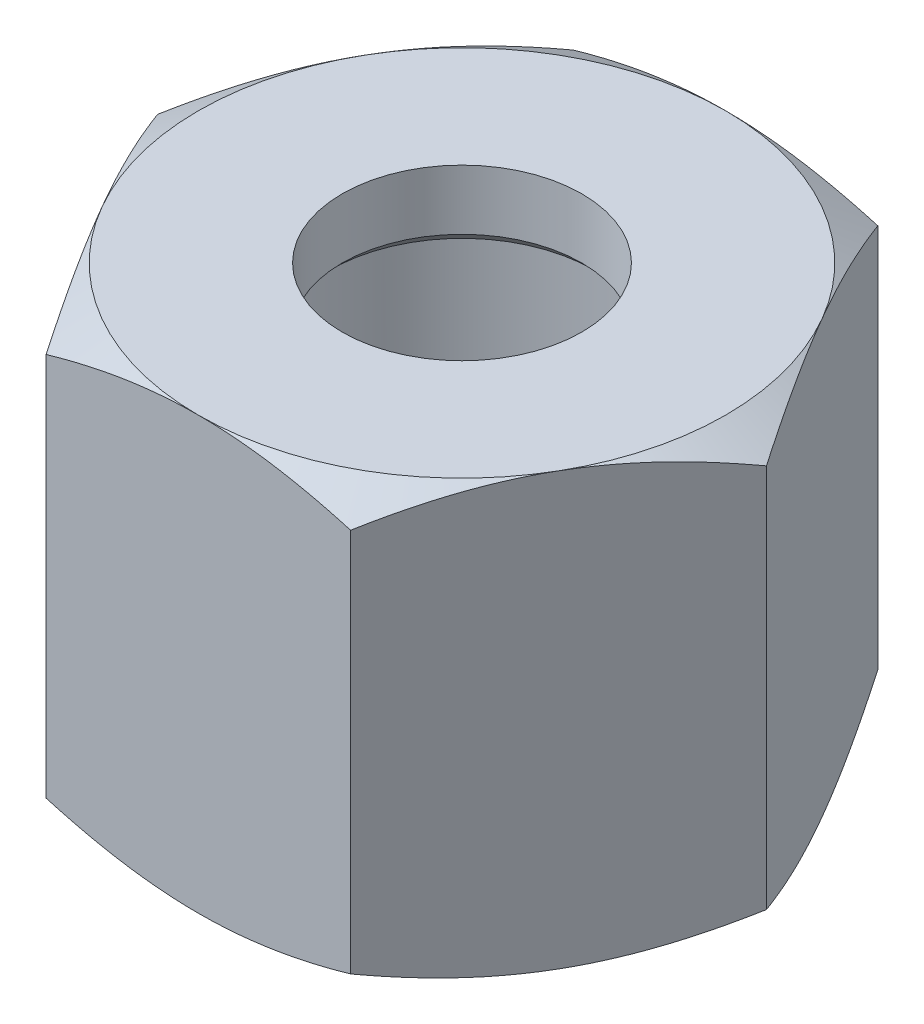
from build123d import *

# Parameters (mm, degrees)
P_IDAT_VYSUNUT_M1_DEPTH  = 18
SKICA2_OUTSIDE_W         = 38.492
SKICA2_OUTSIDE_H         = 35.088
SKICA2_OUTSIDE_R         = 11
ODEBRAT_VYSUNUT_M1_DEPTH = 1
ODEBRAT_VYSUNUT_M1_DRAFT = -60
SKICA3_OUTSIDE_W         = 38.492
SKICA3_OUTSIDE_H         = 35.088
SKICA3_OUTSIDE_R         = 11
ODEBRAT_VYSUNUT_M2_DEPTH = 1
ODEBRAT_VYSUNUT_M2_DRAFT = -60
SKICA4_R                 = 7.75
ODEBRAT_VYSUNUT_M3_DEPTH = 15
ZKOSEN_2_SIZE            = 0.35
ODEBRAT_VYSUNUT_M4_REACH = 26.624
SKICA5_R                 = 5
ZKOSEN_3_SIZE            = 0.5


with BuildPart() as part:
    # Skica1 → P_idat vysunut_m1 (new body)
    with BuildSketch(Plane(origin=(0, 0, 0), x_dir=(1, 0, 0), z_dir=(0, 1, 0))):
        Polygon((12.701705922, 0), (6.350852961, 11), (-6.350852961, 11), (-12.701705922, 0), (-6.350852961, -11), (6.350852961, -11), align=None)
    extrude(amount=P_IDAT_VYSUNUT_M1_DEPTH)


with BuildPart() as odebrat_vysunut_m1_tool:
    # Skica2 outside → Odebrat vysunut_m1 (with draft: the straight prism first)
    with BuildSketch(Plane(origin=(0, 18, 0), x_dir=(1, 0, 0), z_dir=(0, 1, 0))):
        Rectangle(SKICA2_OUTSIDE_W, SKICA2_OUTSIDE_H)
        Circle(SKICA2_OUTSIDE_R, mode=Mode.SUBTRACT)
    extrude(amount=-ODEBRAT_VYSUNUT_M1_DEPTH)
    # Odebrat vysunut_m1: the draft: its side faces are tilted about the plane it starts from
    odebrat_vysunut_m1_sides = [odebrat_vysunut_m1_tool.faces().sort_by_distance(p)[0] for p in [
        (0, 17.5, 17.544),
        (19.246, 17.5, 0),
        (0, 17.5, -17.544),
        (-19.246, 17.5, 0),
        (-11, 17.5, 0),
    ]]
    draft(odebrat_vysunut_m1_sides, Plane(origin=(0, 18, 0), x_dir=(1, 0, 0), z_dir=(0, 1, 0)), ODEBRAT_VYSUNUT_M1_DRAFT)


with BuildPart() as part_1:
    add(part.part)

    # Odebrat vysunut_m1: cut by odebrat_vysunut_m1_tool
    add(odebrat_vysunut_m1_tool.part, mode=Mode.SUBTRACT)


with BuildPart() as odebrat_vysunut_m2_tool:
    # Skica3 outside → Odebrat vysunut_m2 (with draft: the straight prism first)
    with BuildSketch(Plane.XZ):
        Rectangle(SKICA3_OUTSIDE_W, SKICA3_OUTSIDE_H)
        Circle(SKICA3_OUTSIDE_R, mode=Mode.SUBTRACT)
    extrude(amount=-ODEBRAT_VYSUNUT_M2_DEPTH)
    # Odebrat vysunut_m2: the draft: its side faces are tilted about the plane it starts from
    odebrat_vysunut_m2_sides = [odebrat_vysunut_m2_tool.faces().sort_by_distance(p)[0] for p in [
        (0, 0.5, -17.544),
        (19.246, 0.5, 0),
        (0, 0.5, 17.544),
        (-19.246, 0.5, 0),
        (-11, 0.5, 0),
    ]]
    draft(odebrat_vysunut_m2_sides, Plane.XZ, ODEBRAT_VYSUNUT_M2_DRAFT)


with BuildPart() as part_2:
    add(part_1.part)

    # Odebrat vysunut_m2: cut by odebrat_vysunut_m2_tool
    add(odebrat_vysunut_m2_tool.part, mode=Mode.SUBTRACT)

    # Skica4 → Odebrat vysunut_m3 (cut)
    with BuildSketch(Plane.XZ):
        with Locations(Location((0, 0, 0), (0, 0, 270))):
            Circle(SKICA4_R)
    extrude(amount=-ODEBRAT_VYSUNUT_M3_DEPTH, mode=Mode.SUBTRACT)

    # Zkosen_2
    zkosen_2_edges = [part_2.edges().sort_by_distance(p)[0] for p in [
        (0, 0, 7.75),
    ]]
    chamfer(zkosen_2_edges, length=ZKOSEN_2_SIZE)

    # Skica5 → Odebrat vysunut_m4 (cut, up to next)
    with BuildSketch(Plane(origin=(0, 18, 0), x_dir=(1, 0, 0), z_dir=(0, 1, 0)), mode=Mode.PRIVATE) as odebrat_vysunut_m4_sk1:
        with Locations(Location((0, 0, 0), (0, 0, 270))):
            Circle(SKICA5_R)
    odebrat_vysunut_m4_tool1 = extrude(odebrat_vysunut_m4_sk1.sketch, amount=-ODEBRAT_VYSUNUT_M4_REACH, mode=Mode.PRIVATE) & part_2.part
    add(odebrat_vysunut_m4_tool1.solids().sort_by_distance((0, 18, 0))[0], mode=Mode.SUBTRACT)

    # Zkosen_3
    zkosen_3_edges = [part_2.edges().sort_by_distance(p)[0] for p in [
        (0, 15, -5),
    ]]
    chamfer(zkosen_3_edges, length=ZKOSEN_3_SIZE)


solid = part_2.part
